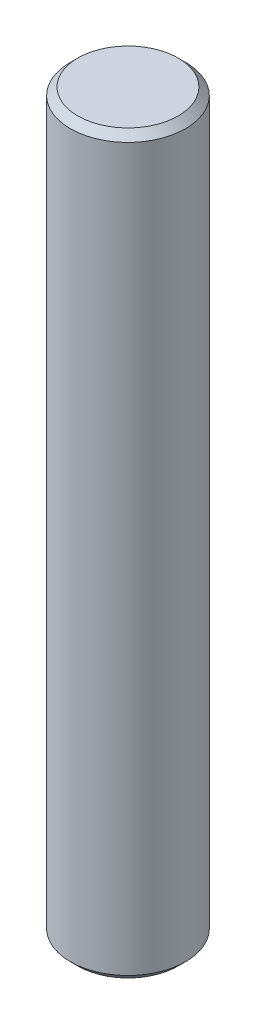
from build123d import *

# Parameters (mm, degrees)
SKETCH1_R      = 3.97129
EXTRUDE1_DEPTH = 25.4
CHAMFER1_SIZE  = 0.508


with BuildPart() as part:
    # Sketch1 → Extrude1 (new, symmetric)
    with BuildSketch(Plane(origin=(0, 0, 0), x_dir=(1, 0, 0), z_dir=(0, 1, 0))):
        with Locations(Location((0, 0, 0), (0, 0, 270))):
            Circle(SKETCH1_R)
    extrude(amount=EXTRUDE1_DEPTH, both=True)

    # Chamfer1
    chamfer1_edges = [part.edges().sort_by_distance(p)[0] for p in [
        (0, -25.4, -3.97129),
        (0, 25.4, -3.97129),
    ]]
    chamfer(chamfer1_edges, length=CHAMFER1_SIZE)


solid = part.part
